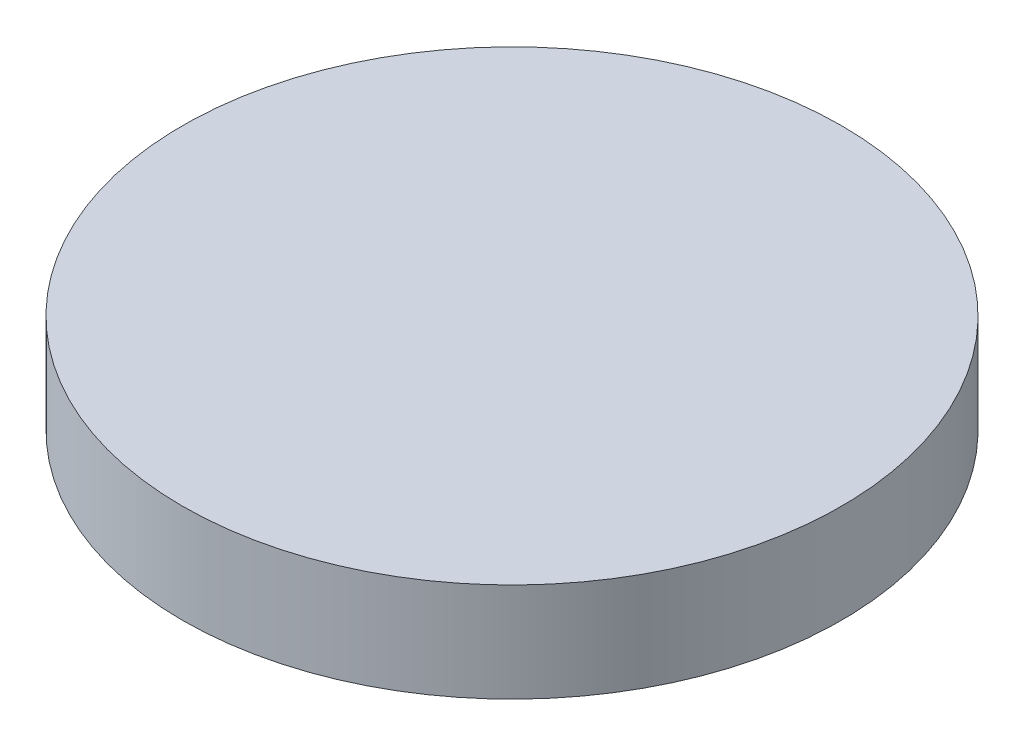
from build123d import *

# Parameters (mm, degrees)
SKETCH1_R           = 12.7
BOSS_EXTRUDE1_DEPTH = 3.81


with BuildPart() as part:
    # Sketch1 → Boss-Extrude1 (new body)
    with BuildSketch(Plane(origin=(0, 0, 0), x_dir=(1, 0, 0), z_dir=(0, 1, 0))):
        with Locations(Location((0, 0, 0), (0, 0, 90))):
            Circle(SKETCH1_R)
    extrude(amount=BOSS_EXTRUDE1_DEPTH)


solid = part.part
